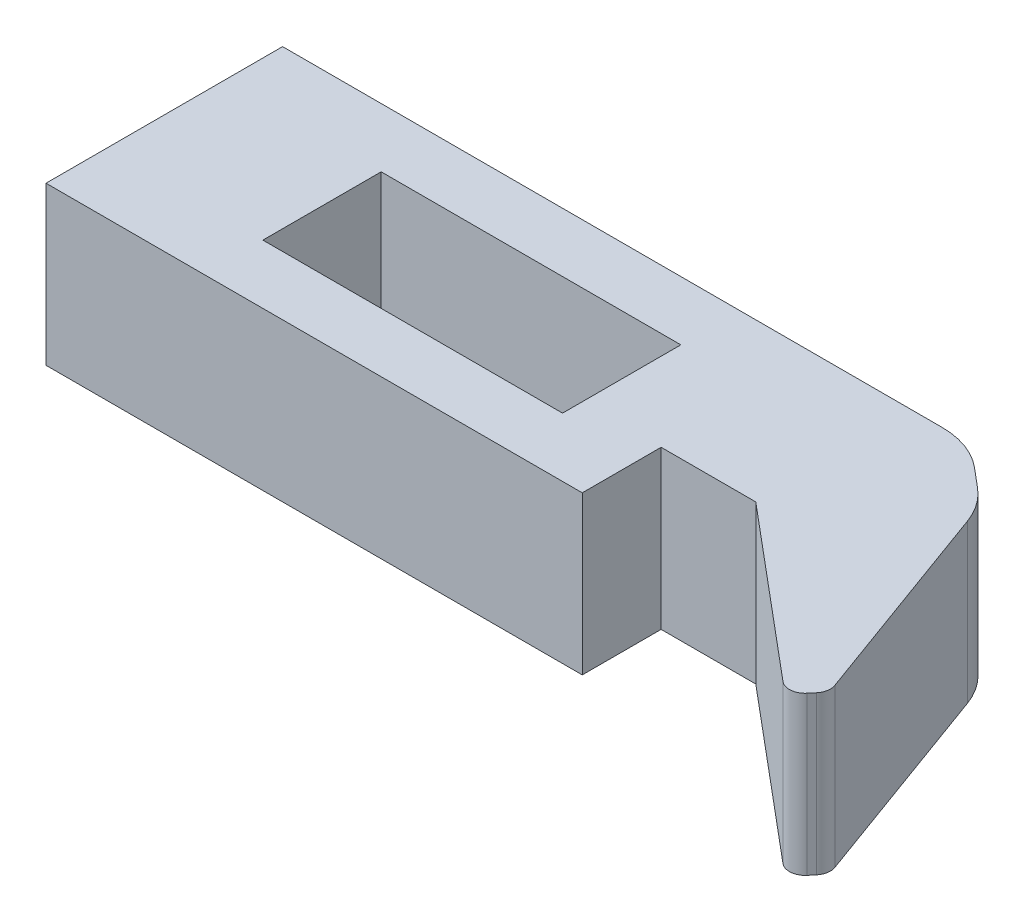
from build123d import *

# Parameters (mm, degrees)
SKETCH_1_W          = 3.8
SKETCH_1_H          = 1.5
EXTRUDE_1_DEPTH     = 2
SKETCH_2_W          = 1
SKETCH_2_H          = 1
CUT_EXTRUDE_1_DEPTH = 9.302790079
CUT_EXTRUDE_2_DEPTH = 9.302790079
FILLET_4_R          = 1
FILLET_5_R          = 0.2


with BuildPart() as part:
    # Sketch 1 → Extrude 1 (new body)
    with BuildSketch(Plane(origin=(0, 0, 0), x_dir=(1, 0, 0), z_dir=(0, 1, 0))):
        Polygon((3.9, -0.5), (4.1, -0.5), (6.398133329, -2.428362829), (7.683708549, -0.896273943), (4.827940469, 1.5), (3.9, 1.5), (-3.9, 1.5), (-3.9, -1.5), (3.9, -1.5), align=None)
        Rectangle(SKETCH_1_W, SKETCH_1_H, mode=Mode.SUBTRACT)
    extrude(amount=EXTRUDE_1_DEPTH)

    # Sketch 2 → Cut-Extrude 1 (cut, through all)
    with BuildSketch(Plane(origin=(0, 2, 0), x_dir=(1, 0, 0), z_dir=(0, 1, 0))):
        with Locations((3.4, -1)):
            Rectangle(SKETCH_2_W, SKETCH_2_H)
    extrude(amount=-CUT_EXTRUDE_1_DEPTH, mode=Mode.SUBTRACT)

    # Sketch 3 → Cut-Extrude 2 (cut, through all)
    with BuildSketch(Plane(origin=(0, 2, 0), x_dir=(1, 0, 0), z_dir=(0, 1, 0))):
        Polygon((6.655248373, -2.121945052), (5.560783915, 0.885071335), (7.683708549, -0.896273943), align=None)
    extrude(amount=-CUT_EXTRUDE_2_DEPTH, mode=Mode.SUBTRACT)

    # Fillet 4
    fillet_4_edges = [part.edges().sort_by_distance(p)[0] for p in [
        (4.827940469, 1, -1.5),
        (5.560783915, 1, -0.885071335),
    ]]
    fillet(fillet_4_edges, radius=FILLET_4_R)

    # Fillet 5
    fillet_5_edges = [part.edges().sort_by_distance(p)[0] for p in [
        (6.398133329, 1, 2.428362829),
        (6.655248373, 1, 2.121945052),
    ]]
    fillet(fillet_5_edges, radius=FILLET_5_R)


solid = part.part
